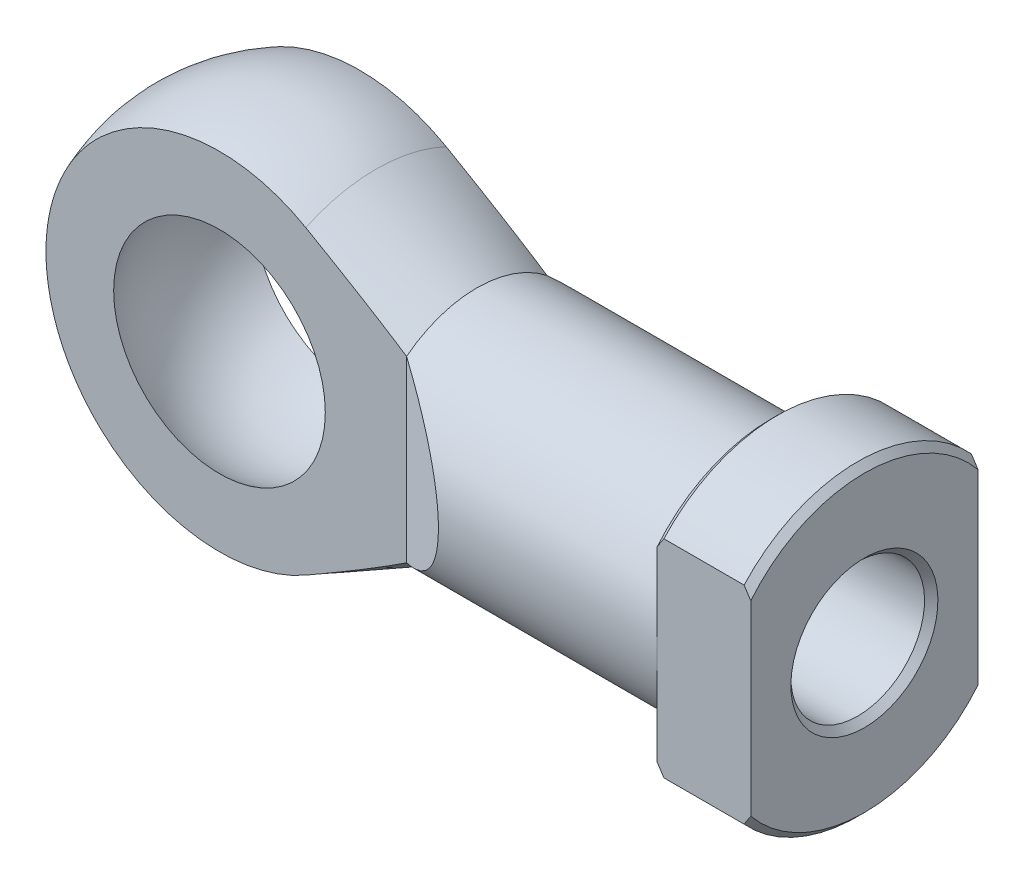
ISO-10303-21;
HEADER;
FILE_DESCRIPTION(('STEP AP214'),'2;1');
FILE_NAME('part.step','',(''),(''),'','','');
FILE_SCHEMA(('AUTOMOTIVE_DESIGN { 1 0 10303 214 1 1 1 1 }'));
ENDSEC;
DATA;
#1=APPLICATION_CONTEXT('core data for automotive mechanical design processes');
#2=APPLICATION_PROTOCOL_DEFINITION('international standard','automotive_design',2000,#1);
#3=PRODUCT_CONTEXT('',#1,'mechanical');
#4=PRODUCT('Part','Part','',(#3));
#5=PRODUCT_RELATED_PRODUCT_CATEGORY('part','',(#4));
#6=PRODUCT_DEFINITION_FORMATION('','',#4);
#7=PRODUCT_DEFINITION_CONTEXT('part definition',#1,'design');
#8=PRODUCT_DEFINITION('design','',#6,#7);
#9=PRODUCT_DEFINITION_SHAPE('','',#8);
#10=(LENGTH_UNIT() NAMED_UNIT(*) SI_UNIT(.MILLI.,.METRE.));
#11=(NAMED_UNIT(*) PLANE_ANGLE_UNIT() SI_UNIT($,.RADIAN.));
#12=(NAMED_UNIT(*) SI_UNIT($,.STERADIAN.) SOLID_ANGLE_UNIT());
#13=UNCERTAINTY_MEASURE_WITH_UNIT(LENGTH_MEASURE(1.E-05),#10,'distance_accuracy_value','');
#14=(GEOMETRIC_REPRESENTATION_CONTEXT(3) GLOBAL_UNCERTAINTY_ASSIGNED_CONTEXT((#13)) GLOBAL_UNIT_ASSIGNED_CONTEXT((#10,
#11,#12)) REPRESENTATION_CONTEXT('',''));
#15=CARTESIAN_POINT('',(0.,0.,0.));
#16=DIRECTION('',(0.,0.,1.));
#17=DIRECTION('',(1.,0.,0.));
#18=AXIS2_PLACEMENT_3D('',#15,#16,#17);
#19=CARTESIAN_POINT('',(-14.,0.,0.));
#20=DIRECTION('',(-1.,0.,0.));
#21=DIRECTION('',(0.,-1.,0.));
#22=AXIS2_PLACEMENT_3D('',#19,#20,#21);
#23=CYLINDRICAL_SURFACE('',#22,11.5);
#24=DIRECTION('',(1.,0.,0.));
#25=VECTOR('',#24,1.);
#26=CARTESIAN_POINT('',(-14.,7.74596669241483,8.5));
#27=LINE('',#26,#25);
#28=CARTESIAN_POINT('',(36.5,7.74596669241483,8.5));
#29=VERTEX_POINT('',#28);
#30=CARTESIAN_POINT('',(42.5,7.74596669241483,8.5));
#31=VERTEX_POINT('',#30);
#32=EDGE_CURVE('E262',#29,#31,#27,.T.);
#33=ORIENTED_EDGE('',*,*,#32,.T.);
#34=CARTESIAN_POINT('',(42.5,0.,0.));
#35=DIRECTION('',(-1.,0.,0.));
#36=DIRECTION('',(0.,-1.,0.));
#37=AXIS2_PLACEMENT_3D('',#34,#35,#36);
#38=CIRCLE('',#37,11.5);
#39=CARTESIAN_POINT('',(42.5,7.74596669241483,-8.5));
#40=VERTEX_POINT('',#39);
#41=EDGE_CURVE('E185',#31,#40,#38,.T.);
#42=ORIENTED_EDGE('',*,*,#41,.T.);
#43=DIRECTION('',(1.,0.,0.));
#44=VECTOR('',#43,1.);
#45=CARTESIAN_POINT('',(-14.,7.74596669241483,-8.5));
#46=LINE('',#45,#44);
#47=CARTESIAN_POINT('',(36.5,7.74596669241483,-8.5));
#48=VERTEX_POINT('',#47);
#49=EDGE_CURVE('E257',#48,#40,#46,.T.);
#50=ORIENTED_EDGE('',*,*,#49,.F.);
#51=CARTESIAN_POINT('',(36.5,0.,0.));
#52=DIRECTION('',(1.,0.,0.));
#53=DIRECTION('',(0.,1.,0.));
#54=AXIS2_PLACEMENT_3D('',#51,#52,#53);
#55=CIRCLE('',#54,11.5);
#56=EDGE_CURVE('E183',#48,#29,#55,.T.);
#57=ORIENTED_EDGE('',*,*,#56,.T.);
#58=EDGE_LOOP('',(#33,#42,#50,#57));
#59=FACE_BOUND('',#58,.T.);
#60=ADVANCED_FACE('F35',(#59),#23,.T.);
#61=CARTESIAN_POINT('',(36.,11.5,0.));
#62=DIRECTION('',(1.,0.,0.));
#63=DIRECTION('',(0.,1.,0.));
#64=AXIS2_PLACEMENT_3D('',#61,#62,#63);
#65=PLANE('',#64);
#66=DIRECTION('',(0.,1.,0.));
#67=VECTOR('',#66,1.);
#68=CARTESIAN_POINT('',(36.,11.5,8.5));
#69=LINE('',#68,#67);
#70=CARTESIAN_POINT('',(36.,0.,8.5));
#71=VERTEX_POINT('',#70);
#72=CARTESIAN_POINT('',(36.,6.98212002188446,8.5));
#73=VERTEX_POINT('',#72);
#74=EDGE_CURVE('E260',#71,#73,#69,.T.);
#75=ORIENTED_EDGE('',*,*,#74,.T.);
#76=CARTESIAN_POINT('',(36.,0.,0.));
#77=DIRECTION('',(1.,0.,0.));
#78=DIRECTION('',(0.,1.,0.));
#79=AXIS2_PLACEMENT_3D('',#76,#77,#78);
#80=CIRCLE('',#79,11.);
#81=CARTESIAN_POINT('',(36.,6.98212002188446,-8.5));
#82=VERTEX_POINT('',#81);
#83=EDGE_CURVE('E11',#73,#82,#80,.F.);
#84=ORIENTED_EDGE('',*,*,#83,.T.);
#85=DIRECTION('',(0.,-1.,0.));
#86=VECTOR('',#85,1.);
#87=CARTESIAN_POINT('',(36.,11.5,-8.5));
#88=LINE('',#87,#86);
#89=CARTESIAN_POINT('',(36.,0.,-8.5));
#90=VERTEX_POINT('',#89);
#91=EDGE_CURVE('E134',#82,#90,#88,.T.);
#92=ORIENTED_EDGE('',*,*,#91,.T.);
#93=CARTESIAN_POINT('',(36.,0.,0.));
#94=DIRECTION('',(-1.,0.,0.));
#95=DIRECTION('',(0.,-1.,0.));
#96=AXIS2_PLACEMENT_3D('',#93,#94,#95);
#97=CIRCLE('',#96,8.5);
#98=EDGE_CURVE('E138',#71,#90,#97,.T.);
#99=ORIENTED_EDGE('',*,*,#98,.F.);
#100=EDGE_LOOP('',(#75,#84,#92,#99));
#101=FACE_BOUND('',#100,.T.);
#102=ADVANCED_FACE('F136',(#101),#65,.F.);
#103=CARTESIAN_POINT('',(14.,0.,0.));
#104=DIRECTION('',(-1.,0.,0.));
#105=DIRECTION('',(0.,-1.,0.));
#106=AXIS2_PLACEMENT_3D('',#103,#104,#105);
#107=CONICAL_SURFACE('',#106,8.5,0.479486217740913);
#108=CARTESIAN_POINT('',(6.45852749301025,0.,0.));
#109=DIRECTION('',(-1.,0.,0.));
#110=DIRECTION('',(0.,-1.,0.));
#111=AXIS2_PLACEMENT_3D('',#108,#109,#110);
#112=CIRCLE('',#111,12.4212488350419);
#113=CARTESIAN_POINT('',(6.45852749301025,-11.2572164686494,-5.25));
#114=VERTEX_POINT('',#113);
#115=CARTESIAN_POINT('',(6.45852749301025,-11.2572164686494,5.25));
#116=VERTEX_POINT('',#115);
#117=EDGE_CURVE('E318',#114,#116,#112,.T.);
#118=ORIENTED_EDGE('',*,*,#117,.F.);
#119=CARTESIAN_POINT('',(-9.11885002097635,-19.8378927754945,-5.25));
#120=CARTESIAN_POINT('',(-8.6071397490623,-19.5626633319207,-5.25));
#121=CARTESIAN_POINT('',(-8.09558406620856,-19.2871465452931,-5.25));
#122=CARTESIAN_POINT('',(-7.0728283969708,-18.7354524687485,-5.25));
#123=CARTESIAN_POINT('',(-6.56162841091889,-18.4592751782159,-5.25));
#124=CARTESIAN_POINT('',(-5.02853602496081,-17.6295720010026,-5.25));
#125=CARTESIAN_POINT('',(-4.00724853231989,-17.0749271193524,-5.25));
#126=CARTESIAN_POINT('',(-1.96341368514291,-15.9598355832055,-5.25));
#127=CARTESIAN_POINT('',(-0.940873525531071,-15.3993757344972,-5.25));
#128=CARTESIAN_POINT('',(1.10115317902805,-14.2731055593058,-5.25));
#129=CARTESIAN_POINT('',(2.12063996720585,-13.7072956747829,-5.25));
#130=CARTESIAN_POINT('',(3.65237816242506,-12.8496041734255,-5.25));
#131=CARTESIAN_POINT('',(4.16623118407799,-12.5605832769,-5.25));
#132=CARTESIAN_POINT('',(5.19257649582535,-11.9801350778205,-5.25));
#133=CARTESIAN_POINT('',(5.70506878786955,-11.688707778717,-5.25));
#134=CARTESIAN_POINT('',(6.72849154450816,-11.1028157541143,-5.25));
#135=CARTESIAN_POINT('',(7.23942157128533,-10.8083502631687,-5.25));
#136=CARTESIAN_POINT('',(8.25911818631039,-10.2157073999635,-5.25));
#137=CARTESIAN_POINT('',(8.76788480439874,-9.91753007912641,-5.25));
#138=CARTESIAN_POINT('',(9.78179317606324,-9.31690082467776,-5.25));
#139=CARTESIAN_POINT('',(10.2869394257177,-9.01445649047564,-5.25));
#140=CARTESIAN_POINT('',(11.2934723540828,-8.40337440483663,-5.25));
#141=CARTESIAN_POINT('',(11.7948591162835,-8.09473679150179,-5.25));
#142=CARTESIAN_POINT('',(12.5428934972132,-7.62554078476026,-5.25));
#143=CARTESIAN_POINT('',(12.7915172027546,-7.46813264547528,-5.25));
#144=CARTESIAN_POINT('',(13.2871710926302,-7.1508293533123,-5.25));
#145=CARTESIAN_POINT('',(13.5342012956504,-6.99093422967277,-5.25));
#146=CARTESIAN_POINT('',(14.0262949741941,-6.66820267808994,-5.25));
#147=CARTESIAN_POINT('',(14.271358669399,-6.50536658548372,-5.25));
#148=CARTESIAN_POINT('',(14.7590779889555,-6.17613238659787,-5.25));
#149=CARTESIAN_POINT('',(15.0017336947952,-6.00973440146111,-5.25));
#150=CARTESIAN_POINT('',(15.3352805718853,-5.7765446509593,-5.25));
#151=CARTESIAN_POINT('',(15.4274740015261,-5.71161316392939,-5.25));
#152=CARTESIAN_POINT('',(15.611366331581,-5.58105096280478,-5.25));
#153=CARTESIAN_POINT('',(15.7030652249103,-5.51542023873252,-5.25));
#154=CARTESIAN_POINT('',(15.977355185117,-5.31738392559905,-5.25));
#155=CARTESIAN_POINT('',(16.159128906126,-5.183841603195,-5.25));
#156=CARTESIAN_POINT('',(16.5203246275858,-4.91289131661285,-5.25));
#157=CARTESIAN_POINT('',(16.6997414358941,-4.77547641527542,-5.25));
#158=CARTESIAN_POINT('',(17.0551474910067,-4.49628970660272,-5.25));
#159=CARTESIAN_POINT('',(17.2311369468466,-4.35451816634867,-5.25));
#160=CARTESIAN_POINT('',(17.5789381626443,-4.06545501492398,-5.25));
#161=CARTESIAN_POINT('',(17.7507440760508,-3.91815633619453,-5.25));
#162=CARTESIAN_POINT('',(18.0884711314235,-3.61697204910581,-5.25));
#163=CARTESIAN_POINT('',(18.2543932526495,-3.46308754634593,-5.25));
#164=CARTESIAN_POINT('',(18.5779081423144,-3.14735131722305,-5.25));
#165=CARTESIAN_POINT('',(18.7355166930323,-2.98551590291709,-5.25));
#166=CARTESIAN_POINT('',(19.039326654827,-2.65155953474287,-5.25));
#167=CARTESIAN_POINT('',(19.1855373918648,-2.47944719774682,-5.25));
#168=CARTESIAN_POINT('',(19.4502928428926,-2.13648532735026,-5.25));
#169=CARTESIAN_POINT('',(19.5701154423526,-1.96663846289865,-5.25));
#170=CARTESIAN_POINT('',(19.7890808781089,-1.61387449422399,-5.25));
#171=CARTESIAN_POINT('',(19.8882364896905,-1.43096555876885,-5.25));
#172=CARTESIAN_POINT('',(20.042314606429,-1.0825756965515,-5.25));
#173=CARTESIAN_POINT('',(20.1018374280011,-0.919203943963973,-5.25));
#174=CARTESIAN_POINT('',(20.1702022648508,-0.668598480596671,-5.25));
#175=CARTESIAN_POINT('',(20.1895001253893,-0.584176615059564,-5.25));
#176=CARTESIAN_POINT('',(20.2204733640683,-0.413961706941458,-5.25));
#177=CARTESIAN_POINT('',(20.2321523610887,-0.328169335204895,-5.25));
#178=CARTESIAN_POINT('',(20.2474707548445,-0.155205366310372,-5.25));
#179=CARTESIAN_POINT('',(20.2510483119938,-0.0680282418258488,-5.25));
#180=CARTESIAN_POINT('',(20.2498278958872,0.106264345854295,-5.25));
#181=CARTESIAN_POINT('',(20.2450300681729,0.193379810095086,-5.25));
#182=CARTESIAN_POINT('',(20.2272586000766,0.366830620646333,-5.25));
#183=CARTESIAN_POINT('',(20.2142791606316,0.45316536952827,-5.25));
#184=CARTESIAN_POINT('',(20.1806777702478,0.624353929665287,-5.25));
#185=CARTESIAN_POINT('',(20.1600510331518,0.70920677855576,-5.25));
#186=CARTESIAN_POINT('',(20.0761710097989,1.00109737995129,-5.25));
#187=CARTESIAN_POINT('',(19.9950057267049,1.20314567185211,-5.25));
#188=CARTESIAN_POINT('',(19.850894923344,1.49459428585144,-5.25));
#189=CARTESIAN_POINT('',(19.7990259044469,1.58995531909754,-5.25));
#190=CARTESIAN_POINT('',(19.6891175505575,1.7770861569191,-5.25));
#191=CARTESIAN_POINT('',(19.6310788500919,1.86885632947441,-5.25));
#192=CARTESIAN_POINT('',(19.4911795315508,2.07695010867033,-5.25));
#193=CARTESIAN_POINT('',(19.4075171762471,2.19205145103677,-5.25));
#194=CARTESIAN_POINT('',(19.2335194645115,2.41713144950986,-5.25));
#195=CARTESIAN_POINT('',(19.1431810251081,2.52710770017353,-5.25));
#196=CARTESIAN_POINT('',(18.9571607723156,2.74274043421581,-5.25));
#197=CARTESIAN_POINT('',(18.8614701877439,2.84838930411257,-5.25));
#198=CARTESIAN_POINT('',(18.6659581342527,3.05579825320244,-5.25));
#199=CARTESIAN_POINT('',(18.5661361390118,3.15755783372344,-5.25));
#200=CARTESIAN_POINT('',(18.3624852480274,3.35839256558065,-5.25));
#201=CARTESIAN_POINT('',(18.2586335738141,3.4574445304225,-5.25));
#202=CARTESIAN_POINT('',(18.0481937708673,3.65259473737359,-5.25));
#203=CARTESIAN_POINT('',(17.9416055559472,3.7486928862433,-5.25));
#204=CARTESIAN_POINT('',(17.726297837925,3.93821105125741,-5.25));
#205=CARTESIAN_POINT('',(17.617580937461,4.03163403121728,-5.25));
#206=CARTESIAN_POINT('',(17.3982683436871,4.21623378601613,-5.25));
#207=CARTESIAN_POINT('',(17.2876727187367,4.30741064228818,-5.25));
#208=CARTESIAN_POINT('',(16.9293748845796,4.59755343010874,-5.25));
#209=CARTESIAN_POINT('',(16.6785728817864,4.79269482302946,-5.25));
#210=CARTESIAN_POINT('',(16.1714330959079,5.17566987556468,-5.25));
#211=CARTESIAN_POINT('',(15.9150943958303,5.36350231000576,-5.25));
#212=CARTESIAN_POINT('',(15.3981838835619,5.73351955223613,-5.25));
#213=CARTESIAN_POINT('',(15.1376099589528,5.91570140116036,-5.25));
#214=CARTESIAN_POINT('',(14.6133156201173,6.27548309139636,-5.25));
#215=CARTESIAN_POINT('',(14.3495951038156,6.45308278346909,-5.25));
#216=CARTESIAN_POINT('',(13.8191441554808,6.80491966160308,-5.25));
#217=CARTESIAN_POINT('',(13.5524086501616,6.97914918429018,-5.25));
#218=CARTESIAN_POINT('',(13.0169475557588,7.32452474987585,-5.25));
#219=CARTESIAN_POINT('',(12.7482219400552,7.49567075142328,-5.25));
#220=CARTESIAN_POINT('',(11.9398040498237,8.00516608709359,-5.25));
#221=CARTESIAN_POINT('',(11.3976986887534,8.33968579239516,-5.25));
#222=CARTESIAN_POINT('',(10.3100170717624,9.00080933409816,-5.25));
#223=CARTESIAN_POINT('',(9.76444864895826,9.32742612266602,-5.25));
#224=CARTESIAN_POINT('',(8.67003905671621,9.97521438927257,-5.25));
#225=CARTESIAN_POINT('',(8.12119765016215,10.2963854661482,-5.25));
#226=CARTESIAN_POINT('',(7.02170851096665,10.934164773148,-5.25));
#227=CARTESIAN_POINT('',(6.47106354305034,11.2507777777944,-5.25));
#228=CARTESIAN_POINT('',(5.36789142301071,11.880708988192,-5.25));
#229=CARTESIAN_POINT('',(4.81536426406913,12.194027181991,-5.25));
#230=CARTESIAN_POINT('',(3.70759546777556,12.8187153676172,-5.25));
#231=CARTESIAN_POINT('',(3.15235052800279,13.1300794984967,-5.25));
#232=CARTESIAN_POINT('',(2.04065125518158,13.7506470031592,-5.25));
#233=CARTESIAN_POINT('',(1.48419691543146,14.0598503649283,-5.25));
#234=CARTESIAN_POINT('',(-0.187045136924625,14.9850302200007,-5.25));
#235=CARTESIAN_POINT('',(-1.30330467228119,15.5983476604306,-5.25));
#236=CARTESIAN_POINT('',(-3.53523040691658,16.818196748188,-5.25));
#237=CARTESIAN_POINT('',(-4.65088857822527,17.4247431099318,-5.25));
#238=CARTESIAN_POINT('',(-6.32563613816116,18.3317047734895,-5.25));
#239=CARTESIAN_POINT('',(-6.8839845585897,18.6334894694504,-5.25));
#240=CARTESIAN_POINT('',(-8.00111079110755,19.2362608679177,-5.25));
#241=CARTESIAN_POINT('',(-8.55988860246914,19.5372475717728,-5.25));
#242=CARTESIAN_POINT('',(-9.11885002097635,19.8378927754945,-5.25));
#243=B_SPLINE_CURVE_WITH_KNOTS('',3,(#119,#120,#121,#122,#123,#124,#125,#126,#127,#128,#129,
#130,#131,#132,#133,#134,#135,#136,#137,#138,#139,#140,#141,#142,#143,#144,#145,#146,#147,#148,
#149,#150,#151,#152,#153,#154,#155,#156,#157,#158,#159,#160,#161,#162,#163,#164,#165,#166,#167,
#168,#169,#170,#171,#172,#173,#174,#175,#176,#177,#178,#179,#180,#181,#182,#183,#184,#185,#186,
#187,#188,#189,#190,#191,#192,#193,#194,#195,#196,#197,#198,#199,#200,#201,#202,#203,#204,#205,
#206,#207,#208,#209,#210,#211,#212,#213,#214,#215,#216,#217,#218,#219,#220,#221,#222,#223,#224,
#225,#226,#227,#228,#229,#230,#231,#232,#233,#234,#235,#236,#237,#238,#239,#240,#241,#242),
.UNSPECIFIED.,.F.,.F.,(4,2,2,2,2,2,2,2,2,2,2,2,2,2,2,2,2,2,2,2,2,2,2,2,2,2,2,2,2,2,2,2,2,2,2,2,
2,2,2,2,2,2,2,2,2,2,2,2,2,2,2,2,2,2,2,2,2,2,2,2,2,4),(0.,1.74309697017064,3.48619556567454,
6.97272425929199,10.4709040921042,13.9687974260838,15.7374648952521,17.5061298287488,
19.2752518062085,21.0443493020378,22.8106173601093,24.576846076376,25.4596254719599,
26.3423944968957,27.2250634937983,28.1077025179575,28.4459918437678,28.7842860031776,
29.4609131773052,30.1388409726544,30.816727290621,31.4955121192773,32.1741834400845,
32.8515162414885,33.5282888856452,34.1508637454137,34.7730526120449,35.2925064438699,
35.5520076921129,35.8113855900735,36.0727367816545,36.3340834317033,36.595615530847,
36.8573115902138,37.5062395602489,37.8317877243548,38.1573024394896,38.5838746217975,
39.0106450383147,39.4381366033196,39.8656827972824,40.2961601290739,40.7266510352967,
41.1566449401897,41.5866232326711,42.5397449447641,43.4930257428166,44.446797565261,
45.4006004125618,46.3563641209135,47.3121406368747,49.223076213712,51.1306325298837,
53.0383287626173,54.9438550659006,56.849388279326,58.7591470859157,60.6689165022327,
64.4898565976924,68.2994841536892,70.2035431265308,72.107598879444),.UNSPECIFIED.);
#244=CARTESIAN_POINT('',(14.,-6.68487097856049,-5.25));
#245=VERTEX_POINT('',#244);
#246=EDGE_CURVE('E279',#114,#245,#243,.T.);
#247=ORIENTED_EDGE('',*,*,#246,.T.);
#248=CARTESIAN_POINT('',(14.,0.,0.));
#249=DIRECTION('',(-1.,0.,0.));
#250=DIRECTION('',(0.,-1.,0.));
#251=AXIS2_PLACEMENT_3D('',#248,#249,#250);
#252=CIRCLE('',#251,8.5);
#253=CARTESIAN_POINT('',(14.,-6.68487097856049,5.25));
#254=VERTEX_POINT('',#253);
#255=EDGE_CURVE('E321',#245,#254,#252,.T.);
#256=ORIENTED_EDGE('',*,*,#255,.T.);
#257=CARTESIAN_POINT('',(-9.11885002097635,19.8378927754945,5.25));
#258=CARTESIAN_POINT('',(-8.6071397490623,19.5626633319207,5.25));
#259=CARTESIAN_POINT('',(-8.09558406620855,19.2871465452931,5.25));
#260=CARTESIAN_POINT('',(-7.07282839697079,18.7354524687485,5.25));
#261=CARTESIAN_POINT('',(-6.56162841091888,18.4592751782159,5.25));
#262=CARTESIAN_POINT('',(-5.02853602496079,17.6295720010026,5.25));
#263=CARTESIAN_POINT('',(-4.00724853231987,17.0749271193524,5.25));
#264=CARTESIAN_POINT('',(-1.96341368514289,15.9598355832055,5.25));
#265=CARTESIAN_POINT('',(-0.94087352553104,15.3993757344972,5.25));
#266=CARTESIAN_POINT('',(1.10115317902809,14.2731055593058,5.25));
#267=CARTESIAN_POINT('',(2.12063996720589,13.7072956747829,5.25));
#268=CARTESIAN_POINT('',(3.6523781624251,12.8496041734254,5.25));
#269=CARTESIAN_POINT('',(4.16623118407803,12.5605832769,5.25));
#270=CARTESIAN_POINT('',(5.19257649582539,11.9801350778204,5.25));
#271=CARTESIAN_POINT('',(5.70506878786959,11.688707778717,5.25));
#272=CARTESIAN_POINT('',(6.72849154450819,11.1028157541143,5.25));
#273=CARTESIAN_POINT('',(7.23942157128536,10.8083502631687,5.25));
#274=CARTESIAN_POINT('',(8.25911818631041,10.2157073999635,5.25));
#275=CARTESIAN_POINT('',(8.76788480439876,9.91753007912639,5.25));
#276=CARTESIAN_POINT('',(9.78179317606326,9.31690082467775,5.25));
#277=CARTESIAN_POINT('',(10.2869394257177,9.01445649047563,5.25));
#278=CARTESIAN_POINT('',(11.2934723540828,8.40337440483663,5.25));
#279=CARTESIAN_POINT('',(11.7948591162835,8.09473679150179,5.25));
#280=CARTESIAN_POINT('',(12.5428934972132,7.62554078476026,5.25));
#281=CARTESIAN_POINT('',(12.7915172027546,7.46813264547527,5.25));
#282=CARTESIAN_POINT('',(13.2871710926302,7.15082935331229,5.25));
#283=CARTESIAN_POINT('',(13.5342012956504,6.99093422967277,5.25));
#284=CARTESIAN_POINT('',(14.0262949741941,6.66820267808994,5.25));
#285=CARTESIAN_POINT('',(14.271358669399,6.50536658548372,5.25));
#286=CARTESIAN_POINT('',(14.7590779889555,6.17613238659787,5.25));
#287=CARTESIAN_POINT('',(15.0017336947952,6.00973440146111,5.25));
#288=CARTESIAN_POINT('',(15.3352805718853,5.7765446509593,5.25));
#289=CARTESIAN_POINT('',(15.4274740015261,5.7116131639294,5.25));
#290=CARTESIAN_POINT('',(15.611366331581,5.58105096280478,5.25));
#291=CARTESIAN_POINT('',(15.7030652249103,5.51542023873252,5.25));
#292=CARTESIAN_POINT('',(15.977355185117,5.31738392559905,5.25));
#293=CARTESIAN_POINT('',(16.159128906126,5.18384160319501,5.25));
#294=CARTESIAN_POINT('',(16.5203246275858,4.91289131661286,5.25));
#295=CARTESIAN_POINT('',(16.6997414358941,4.77547641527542,5.25));
#296=CARTESIAN_POINT('',(17.0551474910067,4.49628970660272,5.25));
#297=CARTESIAN_POINT('',(17.2311369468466,4.35451816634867,5.25));
#298=CARTESIAN_POINT('',(17.5789381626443,4.06545501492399,5.25));
#299=CARTESIAN_POINT('',(17.7507440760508,3.91815633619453,5.25));
#300=CARTESIAN_POINT('',(18.0884711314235,3.61697204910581,5.25));
#301=CARTESIAN_POINT('',(18.2543932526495,3.46308754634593,5.25));
#302=CARTESIAN_POINT('',(18.5779081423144,3.14735131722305,5.25));
#303=CARTESIAN_POINT('',(18.7355166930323,2.98551590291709,5.25));
#304=CARTESIAN_POINT('',(19.039326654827,2.65155953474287,5.25));
#305=CARTESIAN_POINT('',(19.1855373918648,2.47944719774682,5.25));
#306=CARTESIAN_POINT('',(19.4502928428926,2.13648532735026,5.25));
#307=CARTESIAN_POINT('',(19.5701154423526,1.96663846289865,5.25));
#308=CARTESIAN_POINT('',(19.7890808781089,1.61387449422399,5.25));
#309=CARTESIAN_POINT('',(19.8882364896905,1.43096555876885,5.25));
#310=CARTESIAN_POINT('',(20.042314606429,1.0825756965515,5.25));
#311=CARTESIAN_POINT('',(20.1018374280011,0.919203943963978,5.25));
#312=CARTESIAN_POINT('',(20.1702022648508,0.668598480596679,5.25));
#313=CARTESIAN_POINT('',(20.1895001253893,0.584176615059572,5.25));
#314=CARTESIAN_POINT('',(20.2204733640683,0.413961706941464,5.25));
#315=CARTESIAN_POINT('',(20.2321523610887,0.328169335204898,5.25));
#316=CARTESIAN_POINT('',(20.2474707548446,0.155205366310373,5.25));
#317=CARTESIAN_POINT('',(20.2510483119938,0.0680282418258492,5.25));
#318=CARTESIAN_POINT('',(20.2498278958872,-0.106264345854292,5.25));
#319=CARTESIAN_POINT('',(20.2450300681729,-0.193379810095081,5.25));
#320=CARTESIAN_POINT('',(20.2272586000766,-0.366830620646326,5.25));
#321=CARTESIAN_POINT('',(20.2142791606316,-0.453165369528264,5.25));
#322=CARTESIAN_POINT('',(20.1806777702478,-0.624353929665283,5.25));
#323=CARTESIAN_POINT('',(20.1600510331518,-0.709206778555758,5.25));
#324=CARTESIAN_POINT('',(20.0761710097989,-1.00109737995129,5.25));
#325=CARTESIAN_POINT('',(19.9950057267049,-1.20314567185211,5.25));
#326=CARTESIAN_POINT('',(19.8508949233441,-1.49459428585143,5.25));
#327=CARTESIAN_POINT('',(19.7990259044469,-1.58995531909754,5.25));
#328=CARTESIAN_POINT('',(19.6891175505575,-1.77708615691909,5.25));
#329=CARTESIAN_POINT('',(19.6310788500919,-1.8688563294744,5.25));
#330=CARTESIAN_POINT('',(19.4911795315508,-2.07695010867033,5.25));
#331=CARTESIAN_POINT('',(19.4075171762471,-2.19205145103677,5.25));
#332=CARTESIAN_POINT('',(19.2335194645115,-2.41713144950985,5.25));
#333=CARTESIAN_POINT('',(19.1431810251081,-2.52710770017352,5.25));
#334=CARTESIAN_POINT('',(18.9571607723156,-2.74274043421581,5.25));
#335=CARTESIAN_POINT('',(18.861470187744,-2.84838930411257,5.25));
#336=CARTESIAN_POINT('',(18.6659581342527,-3.05579825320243,5.25));
#337=CARTESIAN_POINT('',(18.5661361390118,-3.15755783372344,5.25));
#338=CARTESIAN_POINT('',(18.3624852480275,-3.35839256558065,5.25));
#339=CARTESIAN_POINT('',(18.2586335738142,-3.4574445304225,5.25));
#340=CARTESIAN_POINT('',(18.0481937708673,-3.65259473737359,5.25));
#341=CARTESIAN_POINT('',(17.9416055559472,-3.7486928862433,5.25));
#342=CARTESIAN_POINT('',(17.726297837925,-3.93821105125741,5.25));
#343=CARTESIAN_POINT('',(17.617580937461,-4.03163403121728,5.25));
#344=CARTESIAN_POINT('',(17.3982683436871,-4.21623378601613,5.25));
#345=CARTESIAN_POINT('',(17.2876727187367,-4.30741064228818,5.25));
#346=CARTESIAN_POINT('',(16.9293748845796,-4.59755343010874,5.25));
#347=CARTESIAN_POINT('',(16.6785728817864,-4.79269482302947,5.25));
#348=CARTESIAN_POINT('',(16.1714330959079,-5.17566987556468,5.25));
#349=CARTESIAN_POINT('',(15.9150943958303,-5.36350231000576,5.25));
#350=CARTESIAN_POINT('',(15.3981838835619,-5.73351955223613,5.25));
#351=CARTESIAN_POINT('',(15.1376099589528,-5.91570140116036,5.25));
#352=CARTESIAN_POINT('',(14.6133156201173,-6.27548309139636,5.25));
#353=CARTESIAN_POINT('',(14.3495951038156,-6.45308278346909,5.25));
#354=CARTESIAN_POINT('',(13.8191441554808,-6.80491966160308,5.25));
#355=CARTESIAN_POINT('',(13.5524086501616,-6.97914918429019,5.25));
#356=CARTESIAN_POINT('',(13.0169475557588,-7.32452474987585,5.25));
#357=CARTESIAN_POINT('',(12.7482219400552,-7.49567075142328,5.25));
#358=CARTESIAN_POINT('',(11.9398040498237,-8.00516608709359,5.25));
#359=CARTESIAN_POINT('',(11.3976986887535,-8.33968579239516,5.25));
#360=CARTESIAN_POINT('',(10.3100170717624,-9.00080933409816,5.25));
#361=CARTESIAN_POINT('',(9.76444864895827,-9.32742612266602,5.25));
#362=CARTESIAN_POINT('',(8.67003905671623,-9.97521438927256,5.25));
#363=CARTESIAN_POINT('',(8.12119765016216,-10.2963854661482,5.25));
#364=CARTESIAN_POINT('',(7.02170851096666,-10.934164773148,5.25));
#365=CARTESIAN_POINT('',(6.47106354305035,-11.2507777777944,5.25));
#366=CARTESIAN_POINT('',(5.36789142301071,-11.880708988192,5.25));
#367=CARTESIAN_POINT('',(4.81536426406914,-12.194027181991,5.25));
#368=CARTESIAN_POINT('',(3.70759546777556,-12.8187153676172,5.25));
#369=CARTESIAN_POINT('',(3.15235052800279,-13.1300794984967,5.25));
#370=CARTESIAN_POINT('',(2.04065125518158,-13.7506470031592,5.25));
#371=CARTESIAN_POINT('',(1.48419691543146,-14.0598503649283,5.25));
#372=CARTESIAN_POINT('',(-0.187045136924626,-14.9850302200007,5.25));
#373=CARTESIAN_POINT('',(-1.3033046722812,-15.5983476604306,5.25));
#374=CARTESIAN_POINT('',(-3.53523040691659,-16.818196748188,5.25));
#375=CARTESIAN_POINT('',(-4.65088857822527,-17.4247431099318,5.25));
#376=CARTESIAN_POINT('',(-6.32563613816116,-18.3317047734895,5.25));
#377=CARTESIAN_POINT('',(-6.88398455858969,-18.6334894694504,5.25));
#378=CARTESIAN_POINT('',(-8.00111079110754,-19.2362608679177,5.25));
#379=CARTESIAN_POINT('',(-8.55988860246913,-19.5372475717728,5.25));
#380=CARTESIAN_POINT('',(-9.11885002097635,-19.8378927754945,5.25));
#381=B_SPLINE_CURVE_WITH_KNOTS('',3,(#257,#258,#259,#260,#261,#262,#263,#264,#265,#266,#267,
#268,#269,#270,#271,#272,#273,#274,#275,#276,#277,#278,#279,#280,#281,#282,#283,#284,#285,#286,
#287,#288,#289,#290,#291,#292,#293,#294,#295,#296,#297,#298,#299,#300,#301,#302,#303,#304,#305,
#306,#307,#308,#309,#310,#311,#312,#313,#314,#315,#316,#317,#318,#319,#320,#321,#322,#323,#324,
#325,#326,#327,#328,#329,#330,#331,#332,#333,#334,#335,#336,#337,#338,#339,#340,#341,#342,#343,
#344,#345,#346,#347,#348,#349,#350,#351,#352,#353,#354,#355,#356,#357,#358,#359,#360,#361,#362,
#363,#364,#365,#366,#367,#368,#369,#370,#371,#372,#373,#374,#375,#376,#377,#378,#379,#380),
.UNSPECIFIED.,.F.,.F.,(4,2,2,2,2,2,2,2,2,2,2,2,2,2,2,2,2,2,2,2,2,2,2,2,2,2,2,2,2,2,2,2,2,2,2,2,
2,2,2,2,2,2,2,2,2,2,2,2,2,2,2,2,2,2,2,2,2,2,2,2,2,4),(0.,1.74309697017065,3.48619556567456,
6.97272425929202,10.4709040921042,13.9687974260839,15.7374648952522,17.5061298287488,
19.2752518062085,21.0443493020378,22.8106173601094,24.576846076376,25.4596254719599,
26.3423944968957,27.2250634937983,28.1077025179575,28.4459918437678,28.7842860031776,
29.4609131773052,30.1388409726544,30.816727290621,31.4955121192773,32.1741834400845,
32.8515162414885,33.5282888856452,34.1508637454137,34.7730526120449,35.2925064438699,
35.5520076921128,35.8113855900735,36.0727367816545,36.3340834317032,36.5956155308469,
36.8573115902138,37.5062395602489,37.8317877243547,38.1573024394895,38.5838746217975,
39.0106450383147,39.4381366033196,39.8656827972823,40.2961601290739,40.7266510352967,
41.1566449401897,41.5866232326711,42.5397449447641,43.4930257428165,44.4467975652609,
45.4006004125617,46.3563641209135,47.3121406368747,49.223076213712,51.1306325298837,
53.0383287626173,54.9438550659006,56.8493882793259,58.7591470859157,60.6689165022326,
64.4898565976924,68.2994841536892,70.2035431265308,72.107598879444),.UNSPECIFIED.);
#382=EDGE_CURVE('E306',#254,#116,#381,.T.);
#383=ORIENTED_EDGE('',*,*,#382,.T.);
#384=EDGE_LOOP('',(#118,#247,#256,#383));
#385=FACE_BOUND('',#384,.T.);
#386=ADVANCED_FACE('F337',(#385),#107,.T.);
#387=DIRECTION('',(1.,0.,0.));
#388=VECTOR('',#387,1.);
#389=CARTESIAN_POINT('',(-14.,-7.74596669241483,8.5));
#390=LINE('',#389,#388);
#391=CARTESIAN_POINT('',(36.5,-7.74596669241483,8.5));
#392=VERTEX_POINT('',#391);
#393=CARTESIAN_POINT('',(42.5,-7.74596669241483,8.5));
#394=VERTEX_POINT('',#393);
#395=EDGE_CURVE('E254',#392,#394,#390,.T.);
#396=ORIENTED_EDGE('',*,*,#395,.F.);
#397=CARTESIAN_POINT('',(36.5,0.,0.));
#398=DIRECTION('',(1.,0.,0.));
#399=DIRECTION('',(0.,1.,0.));
#400=AXIS2_PLACEMENT_3D('',#397,#398,#399);
#401=CIRCLE('',#400,11.5);
#402=CARTESIAN_POINT('',(36.5,-7.74596669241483,-8.5));
#403=VERTEX_POINT('',#402);
#404=EDGE_CURVE('E44',#392,#403,#401,.T.);
#405=ORIENTED_EDGE('',*,*,#404,.T.);
#406=DIRECTION('',(1.,0.,0.));
#407=VECTOR('',#406,1.);
#408=CARTESIAN_POINT('',(-14.,-7.74596669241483,-8.5));
#409=LINE('',#408,#407);
#410=CARTESIAN_POINT('',(42.5,-7.74596669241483,-8.5));
#411=VERTEX_POINT('',#410);
#412=EDGE_CURVE('E152',#403,#411,#409,.T.);
#413=ORIENTED_EDGE('',*,*,#412,.T.);
#414=CARTESIAN_POINT('',(42.5,0.,0.));
#415=DIRECTION('',(-1.,0.,0.));
#416=DIRECTION('',(0.,-1.,0.));
#417=AXIS2_PLACEMENT_3D('',#414,#415,#416);
#418=CIRCLE('',#417,11.5);
#419=EDGE_CURVE('E246',#411,#394,#418,.T.);
#420=ORIENTED_EDGE('',*,*,#419,.T.);
#421=EDGE_LOOP('',(#396,#405,#413,#420));
#422=FACE_BOUND('',#421,.T.);
#423=ADVANCED_FACE('F251',(#422),#23,.T.);
#424=CARTESIAN_POINT('',(36.,-6.98212002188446,-8.5));
#425=VERTEX_POINT('',#424);
#426=EDGE_CURVE('E142',#90,#425,#88,.T.);
#427=ORIENTED_EDGE('',*,*,#426,.T.);
#428=CARTESIAN_POINT('',(36.,0.,0.));
#429=DIRECTION('',(1.,0.,0.));
#430=DIRECTION('',(0.,1.,0.));
#431=AXIS2_PLACEMENT_3D('',#428,#429,#430);
#432=CIRCLE('',#431,11.);
#433=CARTESIAN_POINT('',(36.,-6.98212002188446,8.5));
#434=VERTEX_POINT('',#433);
#435=EDGE_CURVE('E244',#425,#434,#432,.F.);
#436=ORIENTED_EDGE('',*,*,#435,.T.);
#437=EDGE_CURVE('E157',#434,#71,#69,.T.);
#438=ORIENTED_EDGE('',*,*,#437,.T.);
#439=EDGE_CURVE('E154',#90,#71,#97,.T.);
#440=ORIENTED_EDGE('',*,*,#439,.F.);
#441=EDGE_LOOP('',(#427,#436,#438,#440));
#442=FACE_BOUND('',#441,.T.);
#443=ADVANCED_FACE('F155',(#442),#65,.F.);
#444=CARTESIAN_POINT('',(-14.,0.,0.));
#445=DIRECTION('',(-1.,0.,0.));
#446=DIRECTION('',(0.,-1.,0.));
#447=AXIS2_PLACEMENT_3D('',#444,#445,#446);
#448=CYLINDRICAL_SURFACE('',#447,8.5);
#449=CARTESIAN_POINT('',(4.90673326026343,0.,0.));
#450=DIRECTION('',(0.500000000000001,0.,0.866025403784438));
#451=DIRECTION('',(-0.866025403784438,0.,0.500000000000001));
#452=AXIS2_PLACEMENT_3D('',#449,#450,#451);
#453=ELLIPSE('',#452,17.,8.5);
#454=CARTESIAN_POINT('',(14.,6.68487097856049,-5.25));
#455=VERTEX_POINT('',#454);
#456=EDGE_CURVE('E280',#245,#455,#453,.T.);
#457=ORIENTED_EDGE('',*,*,#456,.T.);
#458=CARTESIAN_POINT('',(14.,6.68487097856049,5.25));
#459=VERTEX_POINT('',#458);
#460=EDGE_CURVE('E159',#459,#455,#252,.T.);
#461=ORIENTED_EDGE('',*,*,#460,.F.);
#462=CARTESIAN_POINT('',(4.90673326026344,0.,0.));
#463=DIRECTION('',(0.500000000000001,0.,-0.866025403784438));
#464=DIRECTION('',(-0.866025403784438,0.,-0.500000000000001));
#465=AXIS2_PLACEMENT_3D('',#462,#463,#464);
#466=ELLIPSE('',#465,17.,8.5);
#467=EDGE_CURVE('E314',#459,#254,#466,.T.);
#468=ORIENTED_EDGE('',*,*,#467,.T.);
#469=ORIENTED_EDGE('',*,*,#255,.F.);
#470=EDGE_LOOP('',(#457,#461,#468,#469));
#471=FACE_BOUND('',#470,.T.);
#472=ORIENTED_EDGE('',*,*,#98,.T.);
#473=ORIENTED_EDGE('',*,*,#439,.T.);
#474=EDGE_LOOP('',(#472,#473));
#475=FACE_BOUND('',#474,.T.);
#476=ADVANCED_FACE('F161',(#471,#475),#448,.T.);
#477=ORIENTED_EDGE('',*,*,#460,.T.);
#478=CARTESIAN_POINT('',(6.45852749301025,11.2572164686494,-5.25));
#479=VERTEX_POINT('',#478);
#480=EDGE_CURVE('E271',#455,#479,#243,.T.);
#481=ORIENTED_EDGE('',*,*,#480,.T.);
#482=CARTESIAN_POINT('',(6.45852749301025,11.2572164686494,5.25));
#483=VERTEX_POINT('',#482);
#484=EDGE_CURVE('E319',#483,#479,#112,.T.);
#485=ORIENTED_EDGE('',*,*,#484,.F.);
#486=EDGE_CURVE('E312',#483,#459,#381,.T.);
#487=ORIENTED_EDGE('',*,*,#486,.T.);
#488=EDGE_LOOP('',(#477,#481,#485,#487));
#489=FACE_BOUND('',#488,.T.);
#490=ADVANCED_FACE('F282',(#489),#107,.T.);
#491=CARTESIAN_POINT('',(0.,0.,0.));
#492=DIRECTION('',(-1.,0.,0.));
#493=DIRECTION('',(0.,1.,0.));
#494=AXIS2_PLACEMENT_3D('',#491,#492,#493);
#495=SPHERICAL_SURFACE('',#494,14.);
#496=CARTESIAN_POINT('',(0.,0.,-5.25));
#497=DIRECTION('',(0.,0.,1.));
#498=DIRECTION('',(1.,0.,0.));
#499=AXIS2_PLACEMENT_3D('',#496,#497,#498);
#500=CIRCLE('',#499,12.9783473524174);
#501=EDGE_CURVE('E163',#479,#114,#500,.T.);
#502=ORIENTED_EDGE('',*,*,#501,.T.);
#503=ORIENTED_EDGE('',*,*,#117,.T.);
#504=CARTESIAN_POINT('',(0.,0.,5.25));
#505=DIRECTION('',(0.,0.,-1.));
#506=DIRECTION('',(-1.,0.,0.));
#507=AXIS2_PLACEMENT_3D('',#504,#505,#506);
#508=CIRCLE('',#507,12.9783473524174);
#509=EDGE_CURVE('E162',#116,#483,#508,.T.);
#510=ORIENTED_EDGE('',*,*,#509,.T.);
#511=ORIENTED_EDGE('',*,*,#484,.T.);
#512=EDGE_LOOP('',(#502,#503,#510,#511));
#513=FACE_BOUND('',#512,.T.);
#514=ADVANCED_FACE('F327',(#513),#495,.T.);
#515=CARTESIAN_POINT('',(23.,5.,0.));
#516=DIRECTION('',(-1.,0.,0.));
#517=DIRECTION('',(0.,-1.,0.));
#518=AXIS2_PLACEMENT_3D('',#515,#516,#517);
#519=PLANE('',#518);
#520=CARTESIAN_POINT('',(23.,0.,0.));
#521=DIRECTION('',(-1.,0.,0.));
#522=DIRECTION('',(0.,-1.,0.));
#523=AXIS2_PLACEMENT_3D('',#520,#521,#522);
#524=CIRCLE('',#523,5.);
#525=CARTESIAN_POINT('',(23.,-5.,0.));
#526=VERTEX_POINT('',#525);
#527=EDGE_CURVE('E316',#526,#526,#524,.T.);
#528=ORIENTED_EDGE('',*,*,#527,.F.);
#529=EDGE_LOOP('',(#528));
#530=FACE_BOUND('',#529,.T.);
#531=ADVANCED_FACE('F370',(#530),#519,.F.);
#532=CARTESIAN_POINT('',(-14.,0.,0.));
#533=DIRECTION('',(-1.,0.,0.));
#534=DIRECTION('',(0.,-1.,0.));
#535=AXIS2_PLACEMENT_3D('',#532,#533,#534);
#536=CYLINDRICAL_SURFACE('',#535,5.);
#537=CARTESIAN_POINT('',(42.5,0.,0.));
#538=DIRECTION('',(-1.,0.,0.));
#539=DIRECTION('',(0.,-1.,0.));
#540=AXIS2_PLACEMENT_3D('',#537,#538,#539);
#541=CIRCLE('',#540,5.);
#542=CARTESIAN_POINT('',(42.5,-5.,0.));
#543=VERTEX_POINT('',#542);
#544=EDGE_CURVE('E180',#543,#543,#541,.F.);
#545=ORIENTED_EDGE('',*,*,#544,.T.);
#546=EDGE_LOOP('',(#545));
#547=FACE_BOUND('',#546,.T.);
#548=ORIENTED_EDGE('',*,*,#527,.T.);
#549=EDGE_LOOP('',(#548));
#550=FACE_BOUND('',#549,.T.);
#551=ADVANCED_FACE('F387',(#547,#550),#536,.F.);
#552=CARTESIAN_POINT('',(43.,5.,0.));
#553=DIRECTION('',(-1.,0.,0.));
#554=DIRECTION('',(0.,-1.,0.));
#555=AXIS2_PLACEMENT_3D('',#552,#553,#554);
#556=PLANE('',#555);
#557=CARTESIAN_POINT('',(43.,0.,0.));
#558=DIRECTION('',(-1.,0.,0.));
#559=DIRECTION('',(0.,-1.,0.));
#560=AXIS2_PLACEMENT_3D('',#557,#558,#559);
#561=CIRCLE('',#560,5.5);
#562=CARTESIAN_POINT('',(43.,-5.5,0.));
#563=VERTEX_POINT('',#562);
#564=EDGE_CURVE('E177',#563,#563,#561,.T.);
#565=ORIENTED_EDGE('',*,*,#564,.T.);
#566=EDGE_LOOP('',(#565));
#567=FACE_BOUND('',#566,.T.);
#568=DIRECTION('',(0.,-1.,0.));
#569=VECTOR('',#568,1.);
#570=CARTESIAN_POINT('',(43.,7.74596669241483,-8.5));
#571=LINE('',#570,#569);
#572=CARTESIAN_POINT('',(43.,6.98212002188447,-8.5));
#573=VERTEX_POINT('',#572);
#574=CARTESIAN_POINT('',(43.,-6.98212002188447,-8.5));
#575=VERTEX_POINT('',#574);
#576=EDGE_CURVE('E464',#573,#575,#571,.T.);
#577=ORIENTED_EDGE('',*,*,#576,.F.);
#578=CARTESIAN_POINT('',(43.,0.,0.));
#579=DIRECTION('',(-1.,0.,0.));
#580=DIRECTION('',(0.,-1.,0.));
#581=AXIS2_PLACEMENT_3D('',#578,#579,#580);
#582=CIRCLE('',#581,11.);
#583=CARTESIAN_POINT('',(43.,6.98212002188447,8.5));
#584=VERTEX_POINT('',#583);
#585=EDGE_CURVE('E175',#573,#584,#582,.F.);
#586=ORIENTED_EDGE('',*,*,#585,.T.);
#587=DIRECTION('',(0.,1.,0.));
#588=VECTOR('',#587,1.);
#589=CARTESIAN_POINT('',(43.,7.74596669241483,8.5));
#590=LINE('',#589,#588);
#591=CARTESIAN_POINT('',(43.,-6.98212002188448,8.5));
#592=VERTEX_POINT('',#591);
#593=EDGE_CURVE('E141',#592,#584,#590,.T.);
#594=ORIENTED_EDGE('',*,*,#593,.F.);
#595=CARTESIAN_POINT('',(43.,0.,0.));
#596=DIRECTION('',(-1.,0.,0.));
#597=DIRECTION('',(0.,-1.,0.));
#598=AXIS2_PLACEMENT_3D('',#595,#596,#597);
#599=CIRCLE('',#598,11.);
#600=EDGE_CURVE('E169',#592,#575,#599,.F.);
#601=ORIENTED_EDGE('',*,*,#600,.T.);
#602=EDGE_LOOP('',(#577,#586,#594,#601));
#603=FACE_BOUND('',#602,.T.);
#604=ADVANCED_FACE('F298',(#567,#603),#556,.F.);
#605=CARTESIAN_POINT('',(14.,-14.,5.25));
#606=DIRECTION('',(0.500000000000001,0.,-0.866025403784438));
#607=DIRECTION('',(-0.866025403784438,0.,-0.500000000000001));
#608=AXIS2_PLACEMENT_3D('',#605,#606,#607);
#609=PLANE('',#608);
#610=DIRECTION('',(0.,1.,0.));
#611=VECTOR('',#610,1.);
#612=CARTESIAN_POINT('',(14.,-14.,5.25));
#613=LINE('',#612,#611);
#614=EDGE_CURVE('E313',#254,#459,#613,.T.);
#615=ORIENTED_EDGE('',*,*,#614,.F.);
#616=ORIENTED_EDGE('',*,*,#467,.F.);
#617=EDGE_LOOP('',(#615,#616));
#618=FACE_BOUND('',#617,.T.);
#619=ADVANCED_FACE('F294',(#618),#609,.F.);
#620=CARTESIAN_POINT('',(-12.9783473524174,-14.,5.25));
#621=DIRECTION('',(0.,0.,-1.));
#622=DIRECTION('',(-1.,0.,0.));
#623=AXIS2_PLACEMENT_3D('',#620,#621,#622);
#624=PLANE('',#623);
#625=CARTESIAN_POINT('',(0.,0.,5.25));
#626=DIRECTION('',(0.,0.,-1.));
#627=DIRECTION('',(-1.,0.,0.));
#628=AXIS2_PLACEMENT_3D('',#625,#626,#627);
#629=CIRCLE('',#628,7.91754381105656);
#630=CARTESIAN_POINT('',(-7.91754381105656,0.,5.25));
#631=VERTEX_POINT('',#630);
#632=EDGE_CURVE('E173',#631,#631,#629,.F.);
#633=ORIENTED_EDGE('',*,*,#632,.F.);
#634=EDGE_LOOP('',(#633));
#635=FACE_BOUND('',#634,.T.);
#636=ORIENTED_EDGE('',*,*,#486,.F.);
#637=ORIENTED_EDGE('',*,*,#509,.F.);
#638=ORIENTED_EDGE('',*,*,#382,.F.);
#639=ORIENTED_EDGE('',*,*,#614,.T.);
#640=EDGE_LOOP('',(#636,#637,#638,#639));
#641=FACE_BOUND('',#640,.T.);
#642=ADVANCED_FACE('F297',(#635,#641),#624,.F.);
#643=CARTESIAN_POINT('',(14.,-14.,-5.25));
#644=DIRECTION('',(0.500000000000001,0.,0.866025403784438));
#645=DIRECTION('',(0.866025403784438,0.,-0.500000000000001));
#646=AXIS2_PLACEMENT_3D('',#643,#644,#645);
#647=PLANE('',#646);
#648=DIRECTION('',(0.,1.,0.));
#649=VECTOR('',#648,1.);
#650=CARTESIAN_POINT('',(14.,-14.,-5.25));
#651=LINE('',#650,#649);
#652=EDGE_CURVE('E268',#245,#455,#651,.T.);
#653=ORIENTED_EDGE('',*,*,#652,.T.);
#654=ORIENTED_EDGE('',*,*,#456,.F.);
#655=EDGE_LOOP('',(#653,#654));
#656=FACE_BOUND('',#655,.T.);
#657=ADVANCED_FACE('F292',(#656),#647,.F.);
#658=CARTESIAN_POINT('',(-12.9783473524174,-14.,-5.25));
#659=DIRECTION('',(0.,0.,1.));
#660=DIRECTION('',(1.,0.,0.));
#661=AXIS2_PLACEMENT_3D('',#658,#659,#660);
#662=PLANE('',#661);
#663=CARTESIAN_POINT('',(0.,0.,-5.25));
#664=DIRECTION('',(0.,0.,1.));
#665=DIRECTION('',(1.,0.,0.));
#666=AXIS2_PLACEMENT_3D('',#663,#664,#665);
#667=CIRCLE('',#666,7.91754381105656);
#668=CARTESIAN_POINT('',(7.91754381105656,0.,-5.25));
#669=VERTEX_POINT('',#668);
#670=EDGE_CURVE('E170',#669,#669,#667,.F.);
#671=ORIENTED_EDGE('',*,*,#670,.F.);
#672=EDGE_LOOP('',(#671));
#673=FACE_BOUND('',#672,.T.);
#674=ORIENTED_EDGE('',*,*,#246,.F.);
#675=ORIENTED_EDGE('',*,*,#501,.F.);
#676=ORIENTED_EDGE('',*,*,#480,.F.);
#677=ORIENTED_EDGE('',*,*,#652,.F.);
#678=EDGE_LOOP('',(#674,#675,#676,#677));
#679=FACE_BOUND('',#678,.T.);
#680=ADVANCED_FACE('F286',(#673,#679),#662,.F.);
#681=CARTESIAN_POINT('',(0.,0.,0.));
#682=DIRECTION('',(-1.,0.,0.));
#683=DIRECTION('',(0.,-1.,0.));
#684=AXIS2_PLACEMENT_3D('',#681,#682,#683);
#685=SPHERICAL_SURFACE('',#684,9.5);
#686=CARTESIAN_POINT('',(0.,0.,0.));
#687=DIRECTION('',(0.,0.,1.));
#688=DIRECTION('',(1.,0.,0.));
#689=AXIS2_PLACEMENT_3D('',#686,#687,#688);
#690=SPHERICAL_SURFACE('',#689,9.5);
#691=ORIENTED_EDGE('',*,*,#670,.T.);
#692=EDGE_LOOP('',(#691));
#693=FACE_BOUND('',#692,.T.);
#694=ORIENTED_EDGE('',*,*,#632,.T.);
#695=EDGE_LOOP('',(#694));
#696=FACE_BOUND('',#695,.T.);
#697=ADVANCED_FACE('F291',(#693,#696),#690,.F.);
#698=CARTESIAN_POINT('',(-14.,7.74596669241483,8.5));
#699=DIRECTION('',(0.,0.,-1.));
#700=DIRECTION('',(-1.,0.,0.));
#701=AXIS2_PLACEMENT_3D('',#698,#699,#700);
#702=PLANE('',#701);
#703=ORIENTED_EDGE('',*,*,#593,.T.);
#704=CARTESIAN_POINT('',(43.,6.98212002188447,8.5));
#705=CARTESIAN_POINT('',(42.9592271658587,7.04635524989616,8.5));
#706=CARTESIAN_POINT('',(42.9182153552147,7.11043856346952,8.5));
#707=CARTESIAN_POINT('',(42.8357388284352,7.23830892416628,8.5));
#708=CARTESIAN_POINT('',(42.7942741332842,7.30209598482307,8.5));
#709=CARTESIAN_POINT('',(42.710913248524,7.42938712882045,8.5));
#710=CARTESIAN_POINT('',(42.6690170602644,7.49289121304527,8.5));
#711=CARTESIAN_POINT('',(42.5848121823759,7.61962956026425,8.5));
#712=CARTESIAN_POINT('',(42.5425034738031,7.68286381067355,8.5));
#713=CARTESIAN_POINT('',(42.5,7.74596669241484,8.5));
#714=B_SPLINE_CURVE_WITH_KNOTS('',3,(#704,#705,#706,#707,#708,#709,#710,#711,#712,#713),
.UNSPECIFIED.,.F.,.F.,(4,2,2,2,4),(0.,0.228247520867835,0.456484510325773,0.68472078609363,
0.912967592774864),.UNSPECIFIED.);
#715=EDGE_CURVE('E235',#584,#31,#714,.T.);
#716=ORIENTED_EDGE('',*,*,#715,.T.);
#717=ORIENTED_EDGE('',*,*,#32,.F.);
#718=CARTESIAN_POINT('',(36.5,7.74596669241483,8.5));
#719=CARTESIAN_POINT('',(36.4574965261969,7.68286381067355,8.5));
#720=CARTESIAN_POINT('',(36.4151878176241,7.61962956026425,8.5));
#721=CARTESIAN_POINT('',(36.3309829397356,7.49289121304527,8.5));
#722=CARTESIAN_POINT('',(36.2890867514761,7.42938712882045,8.5));
#723=CARTESIAN_POINT('',(36.2057258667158,7.30209598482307,8.5));
#724=CARTESIAN_POINT('',(36.1642611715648,7.23830892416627,8.5));
#725=CARTESIAN_POINT('',(36.0817846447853,7.11043856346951,8.5));
#726=CARTESIAN_POINT('',(36.0407728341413,7.04635524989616,8.5));
#727=CARTESIAN_POINT('',(36.,6.98212002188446,8.5));
#728=B_SPLINE_CURVE_WITH_KNOTS('',3,(#718,#719,#720,#721,#722,#723,#724,#725,#726,#727),
.UNSPECIFIED.,.F.,.F.,(4,2,2,2,4),(0.,0.22824680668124,0.456483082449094,0.684720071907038,
0.912967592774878),.UNSPECIFIED.);
#729=EDGE_CURVE('E59',#29,#73,#728,.T.);
#730=ORIENTED_EDGE('',*,*,#729,.T.);
#731=ORIENTED_EDGE('',*,*,#74,.F.);
#732=ORIENTED_EDGE('',*,*,#437,.F.);
#733=CARTESIAN_POINT('',(36.,-6.98212002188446,8.5));
#734=CARTESIAN_POINT('',(36.0407728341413,-7.04635524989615,8.5));
#735=CARTESIAN_POINT('',(36.0817846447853,-7.11043856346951,8.5));
#736=CARTESIAN_POINT('',(36.1642611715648,-7.23830892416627,8.5));
#737=CARTESIAN_POINT('',(36.2057258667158,-7.30209598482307,8.5));
#738=CARTESIAN_POINT('',(36.2890867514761,-7.42938712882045,8.5));
#739=CARTESIAN_POINT('',(36.3309829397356,-7.49289121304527,8.5));
#740=CARTESIAN_POINT('',(36.4151878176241,-7.61962956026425,8.5));
#741=CARTESIAN_POINT('',(36.4574965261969,-7.68286381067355,8.5));
#742=CARTESIAN_POINT('',(36.5,-7.74596669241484,8.5));
#743=B_SPLINE_CURVE_WITH_KNOTS('',3,(#733,#734,#735,#736,#737,#738,#739,#740,#741,#742),
.UNSPECIFIED.,.F.,.F.,(4,2,2,2,4),(0.,0.228247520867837,0.456484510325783,0.684720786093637,
0.912967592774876),.UNSPECIFIED.);
#744=EDGE_CURVE('E51',#434,#392,#743,.T.);
#745=ORIENTED_EDGE('',*,*,#744,.T.);
#746=ORIENTED_EDGE('',*,*,#395,.T.);
#747=CARTESIAN_POINT('',(42.5,-7.74596669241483,8.5));
#748=CARTESIAN_POINT('',(42.5425034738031,-7.68286381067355,8.5));
#749=CARTESIAN_POINT('',(42.5848121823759,-7.61962956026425,8.5));
#750=CARTESIAN_POINT('',(42.6690170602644,-7.49289121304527,8.5));
#751=CARTESIAN_POINT('',(42.7109132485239,-7.42938712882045,8.5));
#752=CARTESIAN_POINT('',(42.7942741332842,-7.30209598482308,8.5));
#753=CARTESIAN_POINT('',(42.8357388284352,-7.23830892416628,8.5));
#754=CARTESIAN_POINT('',(42.9182153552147,-7.11043856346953,8.5));
#755=CARTESIAN_POINT('',(42.9592271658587,-7.04635524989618,8.5));
#756=CARTESIAN_POINT('',(43.,-6.98212002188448,8.5));
#757=B_SPLINE_CURVE_WITH_KNOTS('',3,(#747,#748,#749,#750,#751,#752,#753,#754,#755,#756),
.UNSPECIFIED.,.F.,.F.,(4,2,2,2,4),(0.,0.228246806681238,0.456483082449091,0.68472007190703,
0.912967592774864),.UNSPECIFIED.);
#758=EDGE_CURVE('E236',#394,#592,#757,.T.);
#759=ORIENTED_EDGE('',*,*,#758,.T.);
#760=EDGE_LOOP('',(#703,#716,#717,#730,#731,#732,#745,#746,#759));
#761=FACE_BOUND('',#760,.T.);
#762=ADVANCED_FACE('F203',(#761),#702,.F.);
#763=CARTESIAN_POINT('',(-14.,7.74596669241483,-8.5));
#764=DIRECTION('',(0.,0.,1.));
#765=DIRECTION('',(1.,0.,0.));
#766=AXIS2_PLACEMENT_3D('',#763,#764,#765);
#767=PLANE('',#766);
#768=ORIENTED_EDGE('',*,*,#49,.T.);
#769=CARTESIAN_POINT('',(42.5,7.74596669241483,-8.5));
#770=CARTESIAN_POINT('',(42.5425034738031,7.68286381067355,-8.5));
#771=CARTESIAN_POINT('',(42.5848121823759,7.61962956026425,-8.5));
#772=CARTESIAN_POINT('',(42.6690170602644,7.49289121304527,-8.5));
#773=CARTESIAN_POINT('',(42.710913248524,7.42938712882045,-8.5));
#774=CARTESIAN_POINT('',(42.7942741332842,7.30209598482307,-8.5));
#775=CARTESIAN_POINT('',(42.8357388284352,7.23830892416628,-8.5));
#776=CARTESIAN_POINT('',(42.9182153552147,7.11043856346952,-8.5));
#777=CARTESIAN_POINT('',(42.9592271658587,7.04635524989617,-8.5));
#778=CARTESIAN_POINT('',(43.,6.98212002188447,-8.5));
#779=B_SPLINE_CURVE_WITH_KNOTS('',3,(#769,#770,#771,#772,#773,#774,#775,#776,#777,#778),
.UNSPECIFIED.,.F.,.F.,(4,2,2,2,4),(0.,0.22824680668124,0.456483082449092,0.684720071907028,
0.912967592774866),.UNSPECIFIED.);
#780=EDGE_CURVE('E214',#40,#573,#779,.T.);
#781=ORIENTED_EDGE('',*,*,#780,.T.);
#782=ORIENTED_EDGE('',*,*,#576,.T.);
#783=CARTESIAN_POINT('',(43.,-6.98212002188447,-8.5));
#784=CARTESIAN_POINT('',(42.9592271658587,-7.04635524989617,-8.5));
#785=CARTESIAN_POINT('',(42.9182153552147,-7.11043856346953,-8.5));
#786=CARTESIAN_POINT('',(42.8357388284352,-7.23830892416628,-8.5));
#787=CARTESIAN_POINT('',(42.7942741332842,-7.30209598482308,-8.5));
#788=CARTESIAN_POINT('',(42.7109132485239,-7.42938712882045,-8.5));
#789=CARTESIAN_POINT('',(42.6690170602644,-7.49289121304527,-8.5));
#790=CARTESIAN_POINT('',(42.5848121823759,-7.61962956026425,-8.5));
#791=CARTESIAN_POINT('',(42.5425034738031,-7.68286381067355,-8.5));
#792=CARTESIAN_POINT('',(42.5,-7.74596669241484,-8.5));
#793=B_SPLINE_CURVE_WITH_KNOTS('',3,(#783,#784,#785,#786,#787,#788,#789,#790,#791,#792),
.UNSPECIFIED.,.F.,.F.,(4,2,2,2,4),(0.,0.228247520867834,0.456484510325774,0.68472078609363,
0.912967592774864),.UNSPECIFIED.);
#794=EDGE_CURVE('E194',#575,#411,#793,.T.);
#795=ORIENTED_EDGE('',*,*,#794,.T.);
#796=ORIENTED_EDGE('',*,*,#412,.F.);
#797=CARTESIAN_POINT('',(36.5,-7.74596669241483,-8.5));
#798=CARTESIAN_POINT('',(36.4574965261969,-7.68286381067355,-8.5));
#799=CARTESIAN_POINT('',(36.4151878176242,-7.61962956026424,-8.5));
#800=CARTESIAN_POINT('',(36.3309829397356,-7.49289121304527,-8.5));
#801=CARTESIAN_POINT('',(36.2890867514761,-7.42938712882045,-8.5));
#802=CARTESIAN_POINT('',(36.2057258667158,-7.30209598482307,-8.5));
#803=CARTESIAN_POINT('',(36.1642611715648,-7.23830892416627,-8.5));
#804=CARTESIAN_POINT('',(36.0817846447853,-7.11043856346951,-8.5));
#805=CARTESIAN_POINT('',(36.0407728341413,-7.04635524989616,-8.5));
#806=CARTESIAN_POINT('',(36.,-6.98212002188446,-8.5));
#807=B_SPLINE_CURVE_WITH_KNOTS('',3,(#797,#798,#799,#800,#801,#802,#803,#804,#805,#806),
.UNSPECIFIED.,.F.,.F.,(4,2,2,2,4),(0.,0.228246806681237,0.456483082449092,0.684720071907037,
0.912967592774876),.UNSPECIFIED.);
#808=EDGE_CURVE('E150',#403,#425,#807,.T.);
#809=ORIENTED_EDGE('',*,*,#808,.T.);
#810=ORIENTED_EDGE('',*,*,#426,.F.);
#811=ORIENTED_EDGE('',*,*,#91,.F.);
#812=CARTESIAN_POINT('',(36.,6.98212002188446,-8.5));
#813=CARTESIAN_POINT('',(36.0407728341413,7.04635524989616,-8.5));
#814=CARTESIAN_POINT('',(36.0817846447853,7.11043856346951,-8.5));
#815=CARTESIAN_POINT('',(36.1642611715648,7.23830892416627,-8.5));
#816=CARTESIAN_POINT('',(36.2057258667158,7.30209598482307,-8.5));
#817=CARTESIAN_POINT('',(36.2890867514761,7.42938712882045,-8.5));
#818=CARTESIAN_POINT('',(36.3309829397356,7.49289121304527,-8.5));
#819=CARTESIAN_POINT('',(36.4151878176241,7.61962956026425,-8.5));
#820=CARTESIAN_POINT('',(36.4574965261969,7.68286381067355,-8.5));
#821=CARTESIAN_POINT('',(36.5,7.74596669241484,-8.5));
#822=B_SPLINE_CURVE_WITH_KNOTS('',3,(#812,#813,#814,#815,#816,#817,#818,#819,#820,#821),
.UNSPECIFIED.,.F.,.F.,(4,2,2,2,4),(0.,0.22824752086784,0.456484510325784,0.684720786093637,
0.912967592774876),.UNSPECIFIED.);
#823=EDGE_CURVE('E188',#82,#48,#822,.T.);
#824=ORIENTED_EDGE('',*,*,#823,.T.);
#825=EDGE_LOOP('',(#768,#781,#782,#795,#796,#809,#810,#811,#824));
#826=FACE_BOUND('',#825,.T.);
#827=ADVANCED_FACE('F147',(#826),#767,.F.);
#828=CARTESIAN_POINT('',(43.,0.,0.));
#829=DIRECTION('',(1.,0.,0.));
#830=DIRECTION('',(0.,1.,0.));
#831=AXIS2_PLACEMENT_3D('',#828,#829,#830);
#832=CONICAL_SURFACE('',#831,5.50000000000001,0.785398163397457);
#833=ORIENTED_EDGE('',*,*,#544,.F.);
#834=EDGE_LOOP('',(#833));
#835=FACE_BOUND('',#834,.T.);
#836=ORIENTED_EDGE('',*,*,#564,.F.);
#837=EDGE_LOOP('',(#836));
#838=FACE_BOUND('',#837,.T.);
#839=ADVANCED_FACE('F202',(#835,#838),#832,.F.);
#840=CARTESIAN_POINT('',(42.5,0.,0.));
#841=DIRECTION('',(-1.,0.,0.));
#842=DIRECTION('',(0.,-1.,0.));
#843=AXIS2_PLACEMENT_3D('',#840,#841,#842);
#844=CONICAL_SURFACE('',#843,11.5,0.785398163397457);
#845=ORIENTED_EDGE('',*,*,#715,.F.);
#846=ORIENTED_EDGE('',*,*,#585,.F.);
#847=ORIENTED_EDGE('',*,*,#780,.F.);
#848=ORIENTED_EDGE('',*,*,#41,.F.);
#849=EDGE_LOOP('',(#845,#846,#847,#848));
#850=FACE_BOUND('',#849,.T.);
#851=ADVANCED_FACE('F224',(#850),#844,.T.);
#852=CARTESIAN_POINT('',(36.,0.,0.));
#853=DIRECTION('',(1.,0.,0.));
#854=DIRECTION('',(0.,1.,0.));
#855=AXIS2_PLACEMENT_3D('',#852,#853,#854);
#856=CONICAL_SURFACE('',#855,11.,0.785398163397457);
#857=ORIENTED_EDGE('',*,*,#808,.F.);
#858=ORIENTED_EDGE('',*,*,#404,.F.);
#859=ORIENTED_EDGE('',*,*,#744,.F.);
#860=ORIENTED_EDGE('',*,*,#435,.F.);
#861=EDGE_LOOP('',(#857,#858,#859,#860));
#862=FACE_BOUND('',#861,.T.);
#863=ADVANCED_FACE('F220',(#862),#856,.T.);
#864=CARTESIAN_POINT('',(42.5,0.,0.));
#865=DIRECTION('',(-1.,0.,0.));
#866=DIRECTION('',(0.,-1.,0.));
#867=AXIS2_PLACEMENT_3D('',#864,#865,#866);
#868=CONICAL_SURFACE('',#867,11.5,0.785398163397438);
#869=ORIENTED_EDGE('',*,*,#794,.F.);
#870=ORIENTED_EDGE('',*,*,#600,.F.);
#871=ORIENTED_EDGE('',*,*,#758,.F.);
#872=ORIENTED_EDGE('',*,*,#419,.F.);
#873=EDGE_LOOP('',(#869,#870,#871,#872));
#874=FACE_BOUND('',#873,.T.);
#875=ADVANCED_FACE('F223',(#874),#868,.T.);
#876=CARTESIAN_POINT('',(36.,0.,0.));
#877=DIRECTION('',(1.,0.,0.));
#878=DIRECTION('',(0.,1.,0.));
#879=AXIS2_PLACEMENT_3D('',#876,#877,#878);
#880=CONICAL_SURFACE('',#879,11.,0.785398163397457);
#881=ORIENTED_EDGE('',*,*,#729,.F.);
#882=ORIENTED_EDGE('',*,*,#56,.F.);
#883=ORIENTED_EDGE('',*,*,#823,.F.);
#884=ORIENTED_EDGE('',*,*,#83,.F.);
#885=EDGE_LOOP('',(#881,#882,#883,#884));
#886=FACE_BOUND('',#885,.T.);
#887=ADVANCED_FACE('F37',(#886),#880,.T.);
#888=CLOSED_SHELL('',(#60,#102,#386,#423,#443,#476,#490,#514,#531,#551,#604,#619,#642,#657,#680,
#697,#762,#827,#839,#851,#863,#875,#887));
#889=MANIFOLD_SOLID_BREP('B2',#888);
#890=ADVANCED_BREP_SHAPE_REPRESENTATION('',(#18,#889),#14);
#891=SHAPE_DEFINITION_REPRESENTATION(#9,#890);
ENDSEC;
END-ISO-10303-21;
